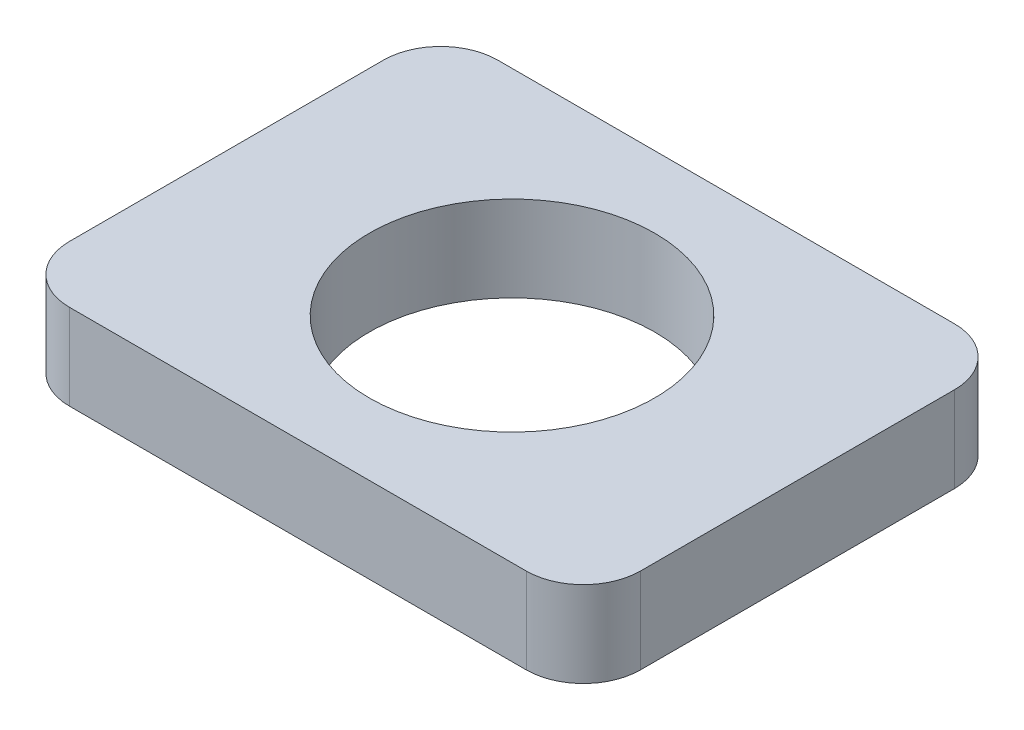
ISO-10303-21;
HEADER;
FILE_DESCRIPTION(('STEP AP214'),'2;1');
FILE_NAME('part.step','',(''),(''),'','','');
FILE_SCHEMA(('AUTOMOTIVE_DESIGN { 1 0 10303 214 1 1 1 1 }'));
ENDSEC;
DATA;
#1=APPLICATION_CONTEXT('core data for automotive mechanical design processes');
#2=APPLICATION_PROTOCOL_DEFINITION('international standard','automotive_design',2000,#1);
#3=PRODUCT_CONTEXT('',#1,'mechanical');
#4=PRODUCT('Part','Part','',(#3));
#5=PRODUCT_RELATED_PRODUCT_CATEGORY('part','',(#4));
#6=PRODUCT_DEFINITION_FORMATION('','',#4);
#7=PRODUCT_DEFINITION_CONTEXT('part definition',#1,'design');
#8=PRODUCT_DEFINITION('design','',#6,#7);
#9=PRODUCT_DEFINITION_SHAPE('','',#8);
#10=(LENGTH_UNIT() NAMED_UNIT(*) SI_UNIT(.MILLI.,.METRE.));
#11=(NAMED_UNIT(*) PLANE_ANGLE_UNIT() SI_UNIT($,.RADIAN.));
#12=(NAMED_UNIT(*) SI_UNIT($,.STERADIAN.) SOLID_ANGLE_UNIT());
#13=UNCERTAINTY_MEASURE_WITH_UNIT(LENGTH_MEASURE(1.E-05),#10,'distance_accuracy_value','');
#14=(GEOMETRIC_REPRESENTATION_CONTEXT(3) GLOBAL_UNCERTAINTY_ASSIGNED_CONTEXT((#13)) GLOBAL_UNIT_ASSIGNED_CONTEXT((#10,
#11,#12)) REPRESENTATION_CONTEXT('',''));
#15=CARTESIAN_POINT('',(0.,0.,0.));
#16=DIRECTION('',(0.,0.,1.));
#17=DIRECTION('',(1.,0.,0.));
#18=AXIS2_PLACEMENT_3D('',#15,#16,#17);
#19=CARTESIAN_POINT('',(0.,3.,0.));
#20=DIRECTION('',(0.,-1.,0.));
#21=DIRECTION('',(0.,0.,-1.));
#22=AXIS2_PLACEMENT_3D('',#19,#20,#21);
#23=PLANE('',#22);
#24=DIRECTION('',(0.,0.,1.));
#25=VECTOR('',#24,1.);
#26=CARTESIAN_POINT('',(-10.,3.,7.5));
#27=LINE('',#26,#25);
#28=CARTESIAN_POINT('',(-10.,3.,-5.5));
#29=VERTEX_POINT('',#28);
#30=CARTESIAN_POINT('',(-10.,3.,5.5));
#31=VERTEX_POINT('',#30);
#32=EDGE_CURVE('E174',#29,#31,#27,.T.);
#33=ORIENTED_EDGE('',*,*,#32,.T.);
#34=CARTESIAN_POINT('',(-8.,3.,5.5));
#35=DIRECTION('',(0.,-1.,0.));
#36=DIRECTION('',(0.,0.,-1.));
#37=AXIS2_PLACEMENT_3D('',#34,#35,#36);
#38=CIRCLE('',#37,2.);
#39=CARTESIAN_POINT('',(-8.,3.,7.5));
#40=VERTEX_POINT('',#39);
#41=EDGE_CURVE('E151',#31,#40,#38,.F.);
#42=ORIENTED_EDGE('',*,*,#41,.T.);
#43=DIRECTION('',(1.,0.,0.));
#44=VECTOR('',#43,1.);
#45=CARTESIAN_POINT('',(-10.,3.,7.5));
#46=LINE('',#45,#44);
#47=CARTESIAN_POINT('',(8.,3.,7.5));
#48=VERTEX_POINT('',#47);
#49=EDGE_CURVE('E122',#40,#48,#46,.T.);
#50=ORIENTED_EDGE('',*,*,#49,.T.);
#51=CARTESIAN_POINT('',(8.,3.,5.5));
#52=DIRECTION('',(0.,-1.,0.));
#53=DIRECTION('',(0.,0.,-1.));
#54=AXIS2_PLACEMENT_3D('',#51,#52,#53);
#55=CIRCLE('',#54,2.);
#56=CARTESIAN_POINT('',(10.,3.,5.5));
#57=VERTEX_POINT('',#56);
#58=EDGE_CURVE('E146',#48,#57,#55,.F.);
#59=ORIENTED_EDGE('',*,*,#58,.T.);
#60=DIRECTION('',(0.,0.,-1.));
#61=VECTOR('',#60,1.);
#62=CARTESIAN_POINT('',(10.,3.,7.5));
#63=LINE('',#62,#61);
#64=CARTESIAN_POINT('',(10.,3.,-5.5));
#65=VERTEX_POINT('',#64);
#66=EDGE_CURVE('E129',#57,#65,#63,.T.);
#67=ORIENTED_EDGE('',*,*,#66,.T.);
#68=CARTESIAN_POINT('',(8.,3.,-5.5));
#69=DIRECTION('',(0.,-1.,0.));
#70=DIRECTION('',(0.,0.,-1.));
#71=AXIS2_PLACEMENT_3D('',#68,#69,#70);
#72=CIRCLE('',#71,2.);
#73=CARTESIAN_POINT('',(8.,3.,-7.5));
#74=VERTEX_POINT('',#73);
#75=EDGE_CURVE('E58',#65,#74,#72,.F.);
#76=ORIENTED_EDGE('',*,*,#75,.T.);
#77=DIRECTION('',(-1.,0.,0.));
#78=VECTOR('',#77,1.);
#79=CARTESIAN_POINT('',(-10.,3.,-7.5));
#80=LINE('',#79,#78);
#81=CARTESIAN_POINT('',(-8.,3.,-7.5));
#82=VERTEX_POINT('',#81);
#83=EDGE_CURVE('E132',#74,#82,#80,.T.);
#84=ORIENTED_EDGE('',*,*,#83,.T.);
#85=CARTESIAN_POINT('',(-8.,3.,-5.5));
#86=DIRECTION('',(0.,-1.,0.));
#87=DIRECTION('',(0.,0.,-1.));
#88=AXIS2_PLACEMENT_3D('',#85,#86,#87);
#89=CIRCLE('',#88,2.);
#90=EDGE_CURVE('E149',#82,#29,#89,.F.);
#91=ORIENTED_EDGE('',*,*,#90,.T.);
#92=EDGE_LOOP('',(#33,#42,#50,#59,#67,#76,#84,#91));
#93=FACE_BOUND('',#92,.T.);
#94=CARTESIAN_POINT('',(0.,3.,0.));
#95=DIRECTION('',(0.,1.,0.));
#96=DIRECTION('',(0.,0.,1.));
#97=AXIS2_PLACEMENT_3D('',#94,#95,#96);
#98=CIRCLE('',#97,5.);
#99=CARTESIAN_POINT('',(0.,3.,5.));
#100=VERTEX_POINT('',#99);
#101=EDGE_CURVE('E167',#100,#100,#98,.T.);
#102=ORIENTED_EDGE('',*,*,#101,.F.);
#103=EDGE_LOOP('',(#102));
#104=FACE_BOUND('',#103,.T.);
#105=ADVANCED_FACE('F36',(#93,#104),#23,.F.);
#106=CARTESIAN_POINT('',(0.,0.,0.));
#107=DIRECTION('',(0.,-1.,0.));
#108=DIRECTION('',(0.,0.,-1.));
#109=AXIS2_PLACEMENT_3D('',#106,#107,#108);
#110=PLANE('',#109);
#111=DIRECTION('',(1.,0.,0.));
#112=VECTOR('',#111,1.);
#113=CARTESIAN_POINT('',(-10.,0.,7.5));
#114=LINE('',#113,#112);
#115=CARTESIAN_POINT('',(-8.,0.,7.5));
#116=VERTEX_POINT('',#115);
#117=CARTESIAN_POINT('',(8.,0.,7.5));
#118=VERTEX_POINT('',#117);
#119=EDGE_CURVE('E119',#116,#118,#114,.T.);
#120=ORIENTED_EDGE('',*,*,#119,.F.);
#121=CARTESIAN_POINT('',(-8.,0.,5.5));
#122=DIRECTION('',(0.,-1.,0.));
#123=DIRECTION('',(0.,0.,-1.));
#124=AXIS2_PLACEMENT_3D('',#121,#122,#123);
#125=CIRCLE('',#124,2.);
#126=CARTESIAN_POINT('',(-10.,0.,5.5));
#127=VERTEX_POINT('',#126);
#128=EDGE_CURVE('E102',#116,#127,#125,.T.);
#129=ORIENTED_EDGE('',*,*,#128,.T.);
#130=DIRECTION('',(0.,0.,1.));
#131=VECTOR('',#130,1.);
#132=CARTESIAN_POINT('',(-10.,0.,7.5));
#133=LINE('',#132,#131);
#134=CARTESIAN_POINT('',(-10.,0.,-5.5));
#135=VERTEX_POINT('',#134);
#136=EDGE_CURVE('E130',#135,#127,#133,.T.);
#137=ORIENTED_EDGE('',*,*,#136,.F.);
#138=CARTESIAN_POINT('',(-8.,0.,-5.5));
#139=DIRECTION('',(0.,-1.,0.));
#140=DIRECTION('',(0.,0.,-1.));
#141=AXIS2_PLACEMENT_3D('',#138,#139,#140);
#142=CIRCLE('',#141,2.);
#143=CARTESIAN_POINT('',(-8.,0.,-7.5));
#144=VERTEX_POINT('',#143);
#145=EDGE_CURVE('E113',#135,#144,#142,.T.);
#146=ORIENTED_EDGE('',*,*,#145,.T.);
#147=DIRECTION('',(-1.,0.,0.));
#148=VECTOR('',#147,1.);
#149=CARTESIAN_POINT('',(-10.,0.,-7.5));
#150=LINE('',#149,#148);
#151=CARTESIAN_POINT('',(8.,0.,-7.5));
#152=VERTEX_POINT('',#151);
#153=EDGE_CURVE('E134',#152,#144,#150,.T.);
#154=ORIENTED_EDGE('',*,*,#153,.F.);
#155=CARTESIAN_POINT('',(8.,0.,-5.5));
#156=DIRECTION('',(0.,-1.,0.));
#157=DIRECTION('',(0.,0.,-1.));
#158=AXIS2_PLACEMENT_3D('',#155,#156,#157);
#159=CIRCLE('',#158,2.);
#160=CARTESIAN_POINT('',(10.,0.,-5.5));
#161=VERTEX_POINT('',#160);
#162=EDGE_CURVE('E140',#152,#161,#159,.T.);
#163=ORIENTED_EDGE('',*,*,#162,.T.);
#164=DIRECTION('',(0.,0.,-1.));
#165=VECTOR('',#164,1.);
#166=CARTESIAN_POINT('',(10.,0.,7.5));
#167=LINE('',#166,#165);
#168=CARTESIAN_POINT('',(10.,0.,5.5));
#169=VERTEX_POINT('',#168);
#170=EDGE_CURVE('E162',#169,#161,#167,.T.);
#171=ORIENTED_EDGE('',*,*,#170,.F.);
#172=CARTESIAN_POINT('',(8.,0.,5.5));
#173=DIRECTION('',(0.,-1.,0.));
#174=DIRECTION('',(0.,0.,-1.));
#175=AXIS2_PLACEMENT_3D('',#172,#173,#174);
#176=CIRCLE('',#175,2.);
#177=EDGE_CURVE('E123',#169,#118,#176,.T.);
#178=ORIENTED_EDGE('',*,*,#177,.T.);
#179=EDGE_LOOP('',(#120,#129,#137,#146,#154,#163,#171,#178));
#180=FACE_BOUND('',#179,.T.);
#181=CARTESIAN_POINT('',(0.,0.,0.));
#182=DIRECTION('',(0.,1.,0.));
#183=DIRECTION('',(0.,0.,1.));
#184=AXIS2_PLACEMENT_3D('',#181,#182,#183);
#185=CIRCLE('',#184,5.);
#186=CARTESIAN_POINT('',(0.,0.,5.));
#187=VERTEX_POINT('',#186);
#188=EDGE_CURVE('E170',#187,#187,#185,.T.);
#189=ORIENTED_EDGE('',*,*,#188,.T.);
#190=EDGE_LOOP('',(#189));
#191=FACE_BOUND('',#190,.T.);
#192=ADVANCED_FACE('F126',(#180,#191),#110,.T.);
#193=CARTESIAN_POINT('',(10.,3.,7.5));
#194=DIRECTION('',(-1.,0.,0.));
#195=DIRECTION('',(0.,0.,1.));
#196=AXIS2_PLACEMENT_3D('',#193,#194,#195);
#197=PLANE('',#196);
#198=ORIENTED_EDGE('',*,*,#170,.T.);
#199=DIRECTION('',(0.,-1.,0.));
#200=VECTOR('',#199,1.);
#201=CARTESIAN_POINT('',(10.,3.,-5.5));
#202=LINE('',#201,#200);
#203=EDGE_CURVE('E11',#161,#65,#202,.F.);
#204=ORIENTED_EDGE('',*,*,#203,.T.);
#205=ORIENTED_EDGE('',*,*,#66,.F.);
#206=DIRECTION('',(0.,-1.,0.));
#207=VECTOR('',#206,1.);
#208=CARTESIAN_POINT('',(10.,3.,5.5));
#209=LINE('',#208,#207);
#210=EDGE_CURVE('E44',#57,#169,#209,.T.);
#211=ORIENTED_EDGE('',*,*,#210,.T.);
#212=EDGE_LOOP('',(#198,#204,#205,#211));
#213=FACE_BOUND('',#212,.T.);
#214=ADVANCED_FACE('F161',(#213),#197,.F.);
#215=CARTESIAN_POINT('',(-10.,3.,-7.5));
#216=DIRECTION('',(0.,0.,1.));
#217=DIRECTION('',(1.,0.,0.));
#218=AXIS2_PLACEMENT_3D('',#215,#216,#217);
#219=PLANE('',#218);
#220=ORIENTED_EDGE('',*,*,#153,.T.);
#221=DIRECTION('',(0.,-1.,0.));
#222=VECTOR('',#221,1.);
#223=CARTESIAN_POINT('',(-8.,3.,-7.5));
#224=LINE('',#223,#222);
#225=EDGE_CURVE('E51',#144,#82,#224,.F.);
#226=ORIENTED_EDGE('',*,*,#225,.T.);
#227=ORIENTED_EDGE('',*,*,#83,.F.);
#228=DIRECTION('',(0.,-1.,0.));
#229=VECTOR('',#228,1.);
#230=CARTESIAN_POINT('',(8.,3.,-7.5));
#231=LINE('',#230,#229);
#232=EDGE_CURVE('E153',#74,#152,#231,.T.);
#233=ORIENTED_EDGE('',*,*,#232,.T.);
#234=EDGE_LOOP('',(#220,#226,#227,#233));
#235=FACE_BOUND('',#234,.T.);
#236=ADVANCED_FACE('F203',(#235),#219,.F.);
#237=CARTESIAN_POINT('',(-10.,3.,7.5));
#238=DIRECTION('',(1.,0.,0.));
#239=DIRECTION('',(0.,0.,-1.));
#240=AXIS2_PLACEMENT_3D('',#237,#238,#239);
#241=PLANE('',#240);
#242=ORIENTED_EDGE('',*,*,#136,.T.);
#243=DIRECTION('',(0.,-1.,0.));
#244=VECTOR('',#243,1.);
#245=CARTESIAN_POINT('',(-10.,3.,5.5));
#246=LINE('',#245,#244);
#247=EDGE_CURVE('E107',#127,#31,#246,.F.);
#248=ORIENTED_EDGE('',*,*,#247,.T.);
#249=ORIENTED_EDGE('',*,*,#32,.F.);
#250=DIRECTION('',(0.,-1.,0.));
#251=VECTOR('',#250,1.);
#252=CARTESIAN_POINT('',(-10.,3.,-5.5));
#253=LINE('',#252,#251);
#254=EDGE_CURVE('E112',#29,#135,#253,.T.);
#255=ORIENTED_EDGE('',*,*,#254,.T.);
#256=EDGE_LOOP('',(#242,#248,#249,#255));
#257=FACE_BOUND('',#256,.T.);
#258=ADVANCED_FACE('F191',(#257),#241,.F.);
#259=CARTESIAN_POINT('',(-10.,3.,7.5));
#260=DIRECTION('',(0.,0.,-1.));
#261=DIRECTION('',(-1.,0.,0.));
#262=AXIS2_PLACEMENT_3D('',#259,#260,#261);
#263=PLANE('',#262);
#264=ORIENTED_EDGE('',*,*,#49,.F.);
#265=DIRECTION('',(0.,-1.,0.));
#266=VECTOR('',#265,1.);
#267=CARTESIAN_POINT('',(-8.,3.,7.5));
#268=LINE('',#267,#266);
#269=EDGE_CURVE('E106',#40,#116,#268,.T.);
#270=ORIENTED_EDGE('',*,*,#269,.T.);
#271=ORIENTED_EDGE('',*,*,#119,.T.);
#272=DIRECTION('',(0.,-1.,0.));
#273=VECTOR('',#272,1.);
#274=CARTESIAN_POINT('',(8.,3.,7.5));
#275=LINE('',#274,#273);
#276=EDGE_CURVE('E124',#118,#48,#275,.F.);
#277=ORIENTED_EDGE('',*,*,#276,.T.);
#278=EDGE_LOOP('',(#264,#270,#271,#277));
#279=FACE_BOUND('',#278,.T.);
#280=ADVANCED_FACE('F118',(#279),#263,.F.);
#281=CARTESIAN_POINT('',(0.,3.,0.));
#282=DIRECTION('',(0.,-1.,0.));
#283=DIRECTION('',(0.,0.,-1.));
#284=AXIS2_PLACEMENT_3D('',#281,#282,#283);
#285=CYLINDRICAL_SURFACE('',#284,5.);
#286=ORIENTED_EDGE('',*,*,#101,.T.);
#287=EDGE_LOOP('',(#286));
#288=FACE_BOUND('',#287,.T.);
#289=ORIENTED_EDGE('',*,*,#188,.F.);
#290=EDGE_LOOP('',(#289));
#291=FACE_BOUND('',#290,.T.);
#292=ADVANCED_FACE('F181',(#288,#291),#285,.F.);
#293=CARTESIAN_POINT('',(-8.,3.,5.5));
#294=DIRECTION('',(0.,-1.,0.));
#295=DIRECTION('',(0.,0.,-1.));
#296=AXIS2_PLACEMENT_3D('',#293,#294,#295);
#297=CYLINDRICAL_SURFACE('',#296,2.);
#298=ORIENTED_EDGE('',*,*,#41,.F.);
#299=ORIENTED_EDGE('',*,*,#247,.F.);
#300=ORIENTED_EDGE('',*,*,#128,.F.);
#301=ORIENTED_EDGE('',*,*,#269,.F.);
#302=EDGE_LOOP('',(#298,#299,#300,#301));
#303=FACE_BOUND('',#302,.T.);
#304=ADVANCED_FACE('F105',(#303),#297,.T.);
#305=CARTESIAN_POINT('',(-8.,3.,-5.5));
#306=DIRECTION('',(0.,-1.,0.));
#307=DIRECTION('',(0.,0.,-1.));
#308=AXIS2_PLACEMENT_3D('',#305,#306,#307);
#309=CYLINDRICAL_SURFACE('',#308,2.);
#310=ORIENTED_EDGE('',*,*,#90,.F.);
#311=ORIENTED_EDGE('',*,*,#225,.F.);
#312=ORIENTED_EDGE('',*,*,#145,.F.);
#313=ORIENTED_EDGE('',*,*,#254,.F.);
#314=EDGE_LOOP('',(#310,#311,#312,#313));
#315=FACE_BOUND('',#314,.T.);
#316=ADVANCED_FACE('F189',(#315),#309,.T.);
#317=CARTESIAN_POINT('',(8.,3.,-5.5));
#318=DIRECTION('',(0.,-1.,0.));
#319=DIRECTION('',(0.,0.,-1.));
#320=AXIS2_PLACEMENT_3D('',#317,#318,#319);
#321=CYLINDRICAL_SURFACE('',#320,2.);
#322=ORIENTED_EDGE('',*,*,#75,.F.);
#323=ORIENTED_EDGE('',*,*,#203,.F.);
#324=ORIENTED_EDGE('',*,*,#162,.F.);
#325=ORIENTED_EDGE('',*,*,#232,.F.);
#326=EDGE_LOOP('',(#322,#323,#324,#325));
#327=FACE_BOUND('',#326,.T.);
#328=ADVANCED_FACE('F210',(#327),#321,.T.);
#329=CARTESIAN_POINT('',(8.,3.,5.5));
#330=DIRECTION('',(0.,-1.,0.));
#331=DIRECTION('',(0.,0.,-1.));
#332=AXIS2_PLACEMENT_3D('',#329,#330,#331);
#333=CYLINDRICAL_SURFACE('',#332,2.);
#334=ORIENTED_EDGE('',*,*,#58,.F.);
#335=ORIENTED_EDGE('',*,*,#276,.F.);
#336=ORIENTED_EDGE('',*,*,#177,.F.);
#337=ORIENTED_EDGE('',*,*,#210,.F.);
#338=EDGE_LOOP('',(#334,#335,#336,#337));
#339=FACE_BOUND('',#338,.T.);
#340=ADVANCED_FACE('F38',(#339),#333,.T.);
#341=CLOSED_SHELL('',(#105,#192,#214,#236,#258,#280,#292,#304,#316,#328,#340));
#342=MANIFOLD_SOLID_BREP('B2',#341);
#343=ADVANCED_BREP_SHAPE_REPRESENTATION('',(#18,#342),#14);
#344=SHAPE_DEFINITION_REPRESENTATION(#9,#343);
ENDSEC;
END-ISO-10303-21;
